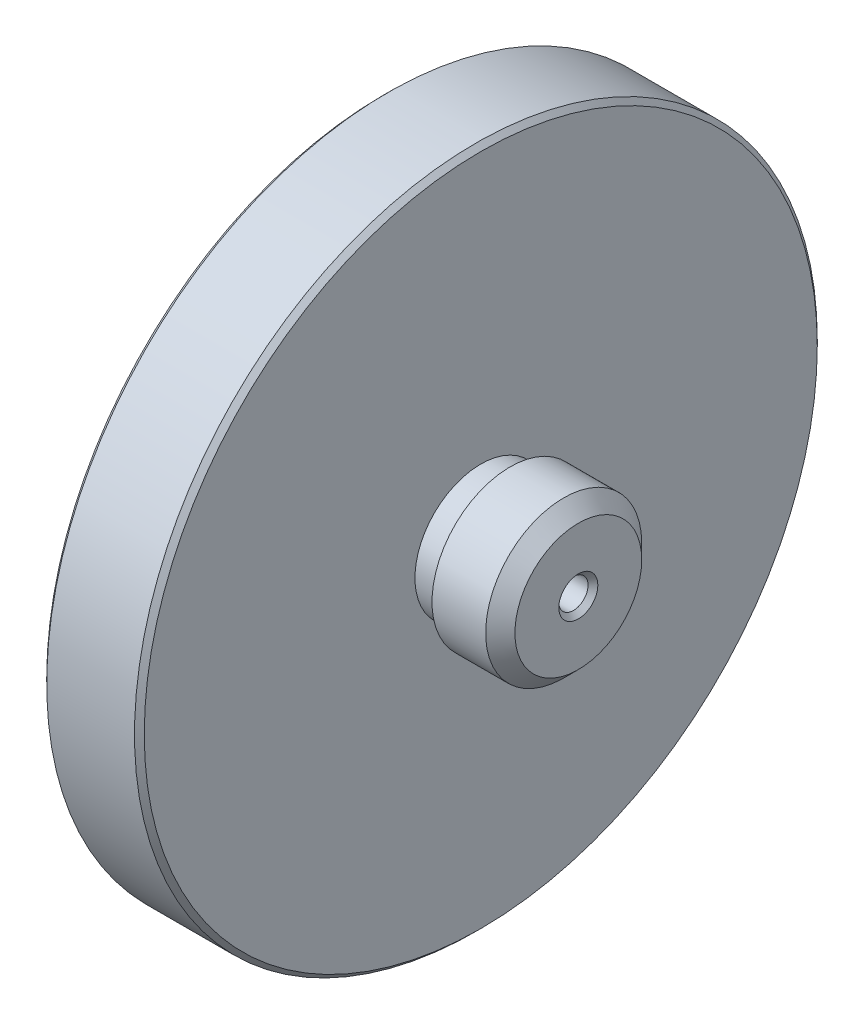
from build123d import *

# Parameters (mm, degrees)
SKETCH_1_R          = 35
EXTRUDE_1_DEPTH     = 10
SKETCH_2_R          = 8
EXTRUDE_2_DEPTH     = 10
SKETCH_3_R          = 4.375
CUT_EXTRUDE_1_DEPTH = 54.38539126
CHAMFER_1_SIZE      = 0.5
SKETCH_4_OUTSIDE_W  = 92.2
SKETCH_4_OUTSIDE_H  = 92.2
SKETCH_4_OUTSIDE_R  = 6.75
CUT_EXTRUDE_2_DEPTH = 3
CHAMFER_2_SIZE      = 1.5
SKETCH_5_R          = 5
EXTRUDE_3_DEPTH     = 4
SKETCH_6_R          = 1.5
CUT_EXTRUDE_3_DEPTH = 4
CHAMFER_3_SIZE      = 0.5


with BuildPart() as part:
    # Sketch 1 → Extrude 1 (new body)
    with BuildSketch(Plane(origin=(0, 0, 0), x_dir=(0, 0, -1), z_dir=(1, 0, 0))):
        Circle(SKETCH_1_R)
    extrude(amount=EXTRUDE_1_DEPTH)

    # Sketch 2 → Extrude 2 (add)
    with BuildSketch(Plane(origin=(10, 0, 0), x_dir=(0, 0, -1), z_dir=(1, 0, 0))):
        Circle(SKETCH_2_R)
    extrude(amount=EXTRUDE_2_DEPTH)

    # Sketch 3 → Cut-Extrude 1 (cut, through all)
    with BuildSketch(Plane(origin=(20, 0, 0), x_dir=(0, 0, -1), z_dir=(1, 0, 0))):
        Circle(SKETCH_3_R)
    extrude(amount=-CUT_EXTRUDE_1_DEPTH, mode=Mode.SUBTRACT)

    # Chamfer 1
    chamfer_1_edges = [part.edges().sort_by_distance(p)[0] for p in [
        (0, 0, 4.375),
        (0, 0, 35),
        (10, 0, 35),
    ]]
    chamfer(chamfer_1_edges, length=CHAMFER_1_SIZE)

    # Sketch 4 outside → Cut-Extrude 2 (cut)
    with BuildSketch(Plane(origin=(10, 0, 0), x_dir=(0, 0, -1), z_dir=(1, 0, 0))):
        Rectangle(SKETCH_4_OUTSIDE_W, SKETCH_4_OUTSIDE_H)
        Circle(SKETCH_4_OUTSIDE_R, mode=Mode.SUBTRACT)
    extrude(amount=CUT_EXTRUDE_2_DEPTH, mode=Mode.SUBTRACT)

    # Chamfer 2
    chamfer_2_edges = [part.edges().sort_by_distance(p)[0] for p in [
        (20, 0, 8),
    ]]
    chamfer(chamfer_2_edges, length=CHAMFER_2_SIZE)

    # Sketch 5 → Extrude 3 (add)
    with BuildSketch(Plane(origin=(20, 0, 0), x_dir=(0, 0, -1), z_dir=(1, 0, 0))):
        Circle(SKETCH_5_R)
    extrude(amount=-EXTRUDE_3_DEPTH)

    # Sketch 6 → Cut-Extrude 3 (cut)
    with BuildSketch(Plane(origin=(20, 0, 0), x_dir=(0, 0, -1), z_dir=(1, 0, 0))):
        Circle(SKETCH_6_R)
    extrude(amount=-CUT_EXTRUDE_3_DEPTH, mode=Mode.SUBTRACT)

    # Chamfer 3
    chamfer_3_edges = [part.edges().sort_by_distance(p)[0] for p in [
        (16, 0, 1.5),
        (20, 0, 1.5),
    ]]
    chamfer(chamfer_3_edges, length=CHAMFER_3_SIZE)


solid = part.part
